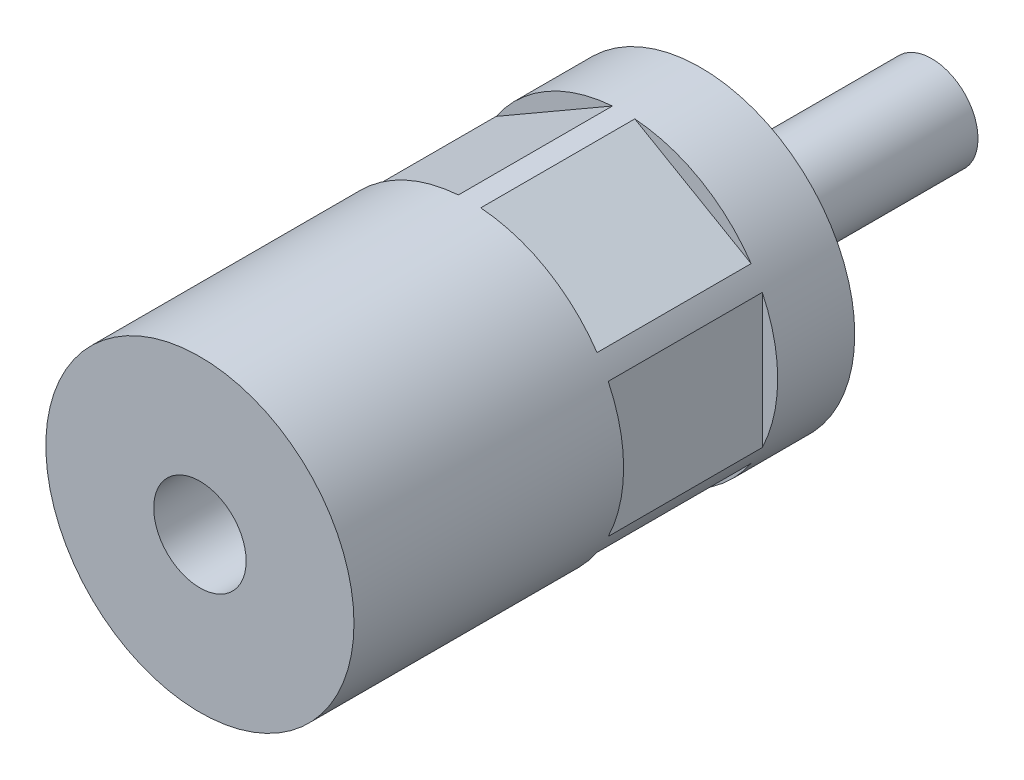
ISO-10303-21;
HEADER;
FILE_DESCRIPTION(('STEP AP214'),'2;1');
FILE_NAME('part.step','',(''),(''),'','','');
FILE_SCHEMA(('AUTOMOTIVE_DESIGN { 1 0 10303 214 1 1 1 1 }'));
ENDSEC;
DATA;
#1=APPLICATION_CONTEXT('core data for automotive mechanical design processes');
#2=APPLICATION_PROTOCOL_DEFINITION('international standard','automotive_design',2000,#1);
#3=PRODUCT_CONTEXT('',#1,'mechanical');
#4=PRODUCT('Part','Part','',(#3));
#5=PRODUCT_RELATED_PRODUCT_CATEGORY('part','',(#4));
#6=PRODUCT_DEFINITION_FORMATION('','',#4);
#7=PRODUCT_DEFINITION_CONTEXT('part definition',#1,'design');
#8=PRODUCT_DEFINITION('design','',#6,#7);
#9=PRODUCT_DEFINITION_SHAPE('','',#8);
#10=(LENGTH_UNIT() NAMED_UNIT(*) SI_UNIT(.MILLI.,.METRE.));
#11=(NAMED_UNIT(*) PLANE_ANGLE_UNIT() SI_UNIT($,.RADIAN.));
#12=(NAMED_UNIT(*) SI_UNIT($,.STERADIAN.) SOLID_ANGLE_UNIT());
#13=UNCERTAINTY_MEASURE_WITH_UNIT(LENGTH_MEASURE(1.E-05),#10,'distance_accuracy_value','');
#14=(GEOMETRIC_REPRESENTATION_CONTEXT(3) GLOBAL_UNCERTAINTY_ASSIGNED_CONTEXT((#13)) GLOBAL_UNIT_ASSIGNED_CONTEXT((#10,
#11,#12)) REPRESENTATION_CONTEXT('',''));
#15=CARTESIAN_POINT('',(0.,0.,0.));
#16=DIRECTION('',(0.,0.,1.));
#17=DIRECTION('',(1.,0.,0.));
#18=AXIS2_PLACEMENT_3D('',#15,#16,#17);
#19=CARTESIAN_POINT('',(0.,0.,80.));
#20=DIRECTION('',(0.,0.,1.));
#21=DIRECTION('',(1.,0.,0.));
#22=AXIS2_PLACEMENT_3D('',#19,#20,#21);
#23=CYLINDRICAL_SURFACE('',#22,20.);
#24=CARTESIAN_POINT('',(0.,0.,10.));
#25=DIRECTION('',(0.,0.,1.));
#26=DIRECTION('',(1.,0.,0.));
#27=AXIS2_PLACEMENT_3D('',#24,#25,#26);
#28=CIRCLE('',#27,20.);
#29=CARTESIAN_POINT('',(-16.5498344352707,-11.2295583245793,10.));
#30=VERTEX_POINT('',#29);
#31=CARTESIAN_POINT('',(-1.45016556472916,-19.9473562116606,10.));
#32=VERTEX_POINT('',#31);
#33=EDGE_CURVE('E152',#30,#32,#28,.T.);
#34=ORIENTED_EDGE('',*,*,#33,.F.);
#35=DIRECTION('',(0.,0.,1.));
#36=VECTOR('',#35,1.);
#37=CARTESIAN_POINT('',(-16.5498344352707,-11.2295583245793,80.));
#38=LINE('',#37,#36);
#39=CARTESIAN_POINT('',(-16.5498344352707,-11.2295583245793,30.));
#40=VERTEX_POINT('',#39);
#41=EDGE_CURVE('E9',#30,#40,#38,.T.);
#42=ORIENTED_EDGE('',*,*,#41,.T.);
#43=CARTESIAN_POINT('',(0.,0.,30.));
#44=DIRECTION('',(0.,0.,1.));
#45=DIRECTION('',(1.,0.,0.));
#46=AXIS2_PLACEMENT_3D('',#43,#44,#45);
#47=CIRCLE('',#46,20.);
#48=CARTESIAN_POINT('',(-1.45016556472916,-19.9473562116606,30.));
#49=VERTEX_POINT('',#48);
#50=EDGE_CURVE('E22',#40,#49,#47,.T.);
#51=ORIENTED_EDGE('',*,*,#50,.T.);
#52=DIRECTION('',(0.,0.,1.));
#53=VECTOR('',#52,1.);
#54=CARTESIAN_POINT('',(-1.45016556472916,-19.9473562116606,80.));
#55=LINE('',#54,#53);
#56=EDGE_CURVE('E149',#49,#32,#55,.F.);
#57=ORIENTED_EDGE('',*,*,#56,.T.);
#58=EDGE_LOOP('',(#34,#42,#51,#57));
#59=FACE_BOUND('',#58,.T.);
#60=DIRECTION('',(0.,0.,1.));
#61=VECTOR('',#60,1.);
#62=CARTESIAN_POINT('',(18.,8.71779788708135,80.));
#63=LINE('',#62,#61);
#64=CARTESIAN_POINT('',(18.,8.71779788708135,10.));
#65=VERTEX_POINT('',#64);
#66=CARTESIAN_POINT('',(18.,8.71779788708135,30.));
#67=VERTEX_POINT('',#66);
#68=EDGE_CURVE('E142',#65,#67,#63,.T.);
#69=ORIENTED_EDGE('',*,*,#68,.F.);
#70=CARTESIAN_POINT('',(18.,-8.71779788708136,10.));
#71=VERTEX_POINT('',#70);
#72=EDGE_CURVE('E141',#71,#65,#28,.T.);
#73=ORIENTED_EDGE('',*,*,#72,.F.);
#74=DIRECTION('',(0.,0.,1.));
#75=VECTOR('',#74,1.);
#76=CARTESIAN_POINT('',(18.,-8.71779788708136,80.));
#77=LINE('',#76,#75);
#78=CARTESIAN_POINT('',(18.,-8.71779788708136,30.));
#79=VERTEX_POINT('',#78);
#80=EDGE_CURVE('E138',#79,#71,#77,.F.);
#81=ORIENTED_EDGE('',*,*,#80,.F.);
#82=EDGE_CURVE('E145',#79,#67,#47,.T.);
#83=ORIENTED_EDGE('',*,*,#82,.T.);
#84=EDGE_LOOP('',(#69,#73,#81,#83));
#85=FACE_BOUND('',#84,.T.);
#86=CARTESIAN_POINT('',(16.5498344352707,11.2295583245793,10.));
#87=VERTEX_POINT('',#86);
#88=CARTESIAN_POINT('',(1.45016556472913,19.9473562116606,10.));
#89=VERTEX_POINT('',#88);
#90=EDGE_CURVE('E134',#87,#89,#28,.T.);
#91=ORIENTED_EDGE('',*,*,#90,.F.);
#92=DIRECTION('',(0.,0.,1.));
#93=VECTOR('',#92,1.);
#94=CARTESIAN_POINT('',(16.5498344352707,11.2295583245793,80.));
#95=LINE('',#94,#93);
#96=CARTESIAN_POINT('',(16.5498344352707,11.2295583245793,30.));
#97=VERTEX_POINT('',#96);
#98=EDGE_CURVE('E135',#87,#97,#95,.T.);
#99=ORIENTED_EDGE('',*,*,#98,.T.);
#100=CARTESIAN_POINT('',(1.45016556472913,19.9473562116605,30.));
#101=VERTEX_POINT('',#100);
#102=EDGE_CURVE('E139',#97,#101,#47,.T.);
#103=ORIENTED_EDGE('',*,*,#102,.T.);
#104=DIRECTION('',(0.,0.,1.));
#105=VECTOR('',#104,1.);
#106=CARTESIAN_POINT('',(1.45016556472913,19.9473562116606,80.));
#107=LINE('',#106,#105);
#108=EDGE_CURVE('E131',#101,#89,#107,.F.);
#109=ORIENTED_EDGE('',*,*,#108,.T.);
#110=EDGE_LOOP('',(#91,#99,#103,#109));
#111=FACE_BOUND('',#110,.T.);
#112=CARTESIAN_POINT('',(0.,0.,0.));
#113=DIRECTION('',(0.,0.,1.));
#114=DIRECTION('',(1.,0.,0.));
#115=AXIS2_PLACEMENT_3D('',#112,#113,#114);
#116=CIRCLE('',#115,20.);
#117=CARTESIAN_POINT('',(20.,0.,0.));
#118=VERTEX_POINT('',#117);
#119=EDGE_CURVE('E204',#118,#118,#116,.T.);
#120=ORIENTED_EDGE('',*,*,#119,.T.);
#121=EDGE_LOOP('',(#120));
#122=FACE_BOUND('',#121,.T.);
#123=CARTESIAN_POINT('',(0.,0.,65.));
#124=DIRECTION('',(0.,0.,1.));
#125=DIRECTION('',(1.,0.,0.));
#126=AXIS2_PLACEMENT_3D('',#123,#124,#125);
#127=CIRCLE('',#126,20.);
#128=CARTESIAN_POINT('',(20.,0.,65.));
#129=VERTEX_POINT('',#128);
#130=EDGE_CURVE('E201',#129,#129,#127,.T.);
#131=ORIENTED_EDGE('',*,*,#130,.F.);
#132=EDGE_LOOP('',(#131));
#133=FACE_BOUND('',#132,.T.);
#134=CARTESIAN_POINT('',(-18.,8.71779788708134,10.));
#135=VERTEX_POINT('',#134);
#136=CARTESIAN_POINT('',(-18.,-8.71779788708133,10.));
#137=VERTEX_POINT('',#136);
#138=EDGE_CURVE('E111',#135,#137,#28,.T.);
#139=ORIENTED_EDGE('',*,*,#138,.F.);
#140=DIRECTION('',(0.,0.,1.));
#141=VECTOR('',#140,1.);
#142=CARTESIAN_POINT('',(-18.,8.71779788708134,80.));
#143=LINE('',#142,#141);
#144=CARTESIAN_POINT('',(-18.,8.71779788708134,30.));
#145=VERTEX_POINT('',#144);
#146=EDGE_CURVE('E110',#135,#145,#143,.T.);
#147=ORIENTED_EDGE('',*,*,#146,.T.);
#148=CARTESIAN_POINT('',(-18.,-8.71779788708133,30.));
#149=VERTEX_POINT('',#148);
#150=EDGE_CURVE('E103',#145,#149,#47,.T.);
#151=ORIENTED_EDGE('',*,*,#150,.T.);
#152=DIRECTION('',(0.,0.,1.));
#153=VECTOR('',#152,1.);
#154=CARTESIAN_POINT('',(-18.,-8.71779788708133,80.));
#155=LINE('',#154,#153);
#156=EDGE_CURVE('E117',#149,#137,#155,.F.);
#157=ORIENTED_EDGE('',*,*,#156,.T.);
#158=EDGE_LOOP('',(#139,#147,#151,#157));
#159=FACE_BOUND('',#158,.T.);
#160=DIRECTION('',(0.,0.,1.));
#161=VECTOR('',#160,1.);
#162=CARTESIAN_POINT('',(-16.5498344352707,11.2295583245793,80.));
#163=LINE('',#162,#161);
#164=CARTESIAN_POINT('',(-16.5498344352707,11.2295583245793,10.));
#165=VERTEX_POINT('',#164);
#166=CARTESIAN_POINT('',(-16.5498344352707,11.2295583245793,30.));
#167=VERTEX_POINT('',#166);
#168=EDGE_CURVE('E129',#165,#167,#163,.T.);
#169=ORIENTED_EDGE('',*,*,#168,.F.);
#170=CARTESIAN_POINT('',(-1.45016556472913,19.9473562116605,10.));
#171=VERTEX_POINT('',#170);
#172=EDGE_CURVE('E125',#171,#165,#28,.T.);
#173=ORIENTED_EDGE('',*,*,#172,.F.);
#174=DIRECTION('',(0.,0.,1.));
#175=VECTOR('',#174,1.);
#176=CARTESIAN_POINT('',(-1.45016556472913,19.9473562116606,80.));
#177=LINE('',#176,#175);
#178=CARTESIAN_POINT('',(-1.45016556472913,19.9473562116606,30.));
#179=VERTEX_POINT('',#178);
#180=EDGE_CURVE('E123',#179,#171,#177,.F.);
#181=ORIENTED_EDGE('',*,*,#180,.F.);
#182=EDGE_CURVE('E113',#179,#167,#47,.T.);
#183=ORIENTED_EDGE('',*,*,#182,.T.);
#184=EDGE_LOOP('',(#169,#173,#181,#183));
#185=FACE_BOUND('',#184,.T.);
#186=DIRECTION('',(0.,0.,1.));
#187=VECTOR('',#186,1.);
#188=CARTESIAN_POINT('',(16.5498344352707,-11.2295583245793,80.));
#189=LINE('',#188,#187);
#190=CARTESIAN_POINT('',(16.5498344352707,-11.2295583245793,10.));
#191=VERTEX_POINT('',#190);
#192=CARTESIAN_POINT('',(16.5498344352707,-11.2295583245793,30.));
#193=VERTEX_POINT('',#192);
#194=EDGE_CURVE('E148',#191,#193,#189,.T.);
#195=ORIENTED_EDGE('',*,*,#194,.F.);
#196=CARTESIAN_POINT('',(1.45016556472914,-19.9473562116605,10.));
#197=VERTEX_POINT('',#196);
#198=EDGE_CURVE('E147',#197,#191,#28,.T.);
#199=ORIENTED_EDGE('',*,*,#198,.F.);
#200=DIRECTION('',(0.,0.,1.));
#201=VECTOR('',#200,1.);
#202=CARTESIAN_POINT('',(1.45016556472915,-19.9473562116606,80.));
#203=LINE('',#202,#201);
#204=CARTESIAN_POINT('',(1.45016556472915,-19.9473562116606,30.));
#205=VERTEX_POINT('',#204);
#206=EDGE_CURVE('E144',#205,#197,#203,.F.);
#207=ORIENTED_EDGE('',*,*,#206,.F.);
#208=EDGE_CURVE('E150',#205,#193,#47,.T.);
#209=ORIENTED_EDGE('',*,*,#208,.T.);
#210=EDGE_LOOP('',(#195,#199,#207,#209));
#211=FACE_BOUND('',#210,.T.);
#212=ADVANCED_FACE('F14',(#59,#85,#111,#122,#133,#159,#185,#211),#23,.T.);
#213=CARTESIAN_POINT('',(0.,0.,-30.));
#214=DIRECTION('',(0.,0.,1.));
#215=DIRECTION('',(1.,0.,0.));
#216=AXIS2_PLACEMENT_3D('',#213,#214,#215);
#217=PLANE('',#216);
#218=CARTESIAN_POINT('',(0.,0.,-30.));
#219=DIRECTION('',(0.,0.,1.));
#220=DIRECTION('',(1.,0.,0.));
#221=AXIS2_PLACEMENT_3D('',#218,#219,#220);
#222=CIRCLE('',#221,6.);
#223=CARTESIAN_POINT('',(6.,0.,-30.));
#224=VERTEX_POINT('',#223);
#225=EDGE_CURVE('E159',#224,#224,#222,.T.);
#226=ORIENTED_EDGE('',*,*,#225,.F.);
#227=EDGE_LOOP('',(#226));
#228=FACE_BOUND('',#227,.T.);
#229=ADVANCED_FACE('F16',(#228),#217,.F.);
#230=CARTESIAN_POINT('',(0.,0.,80.));
#231=DIRECTION('',(0.,0.,1.));
#232=DIRECTION('',(1.,0.,0.));
#233=AXIS2_PLACEMENT_3D('',#230,#231,#232);
#234=CYLINDRICAL_SURFACE('',#233,6.);
#235=CARTESIAN_POINT('',(0.,0.,-3.5));
#236=DIRECTION('',(0.,0.,1.));
#237=DIRECTION('',(1.,0.,0.));
#238=AXIS2_PLACEMENT_3D('',#235,#236,#237);
#239=CIRCLE('',#238,6.);
#240=CARTESIAN_POINT('',(6.,0.,-3.5));
#241=VERTEX_POINT('',#240);
#242=EDGE_CURVE('E213',#241,#241,#239,.T.);
#243=ORIENTED_EDGE('',*,*,#242,.F.);
#244=EDGE_LOOP('',(#243));
#245=FACE_BOUND('',#244,.T.);
#246=ORIENTED_EDGE('',*,*,#225,.T.);
#247=EDGE_LOOP('',(#246));
#248=FACE_BOUND('',#247,.T.);
#249=ADVANCED_FACE('F219',(#245,#248),#234,.T.);
#250=CARTESIAN_POINT('',(4.7,0.,-3.5));
#251=DIRECTION('',(0.,0.,1.));
#252=DIRECTION('',(1.,0.,0.));
#253=AXIS2_PLACEMENT_3D('',#250,#251,#252);
#254=PLANE('',#253);
#255=ORIENTED_EDGE('',*,*,#242,.T.);
#256=EDGE_LOOP('',(#255));
#257=FACE_BOUND('',#256,.T.);
#258=CARTESIAN_POINT('',(0.,0.,-3.5));
#259=DIRECTION('',(0.,0.,1.));
#260=DIRECTION('',(1.,0.,0.));
#261=AXIS2_PLACEMENT_3D('',#258,#259,#260);
#262=CIRCLE('',#261,4.7);
#263=CARTESIAN_POINT('',(4.7,0.,-3.5));
#264=VERTEX_POINT('',#263);
#265=EDGE_CURVE('E210',#264,#264,#262,.T.);
#266=ORIENTED_EDGE('',*,*,#265,.F.);
#267=EDGE_LOOP('',(#266));
#268=FACE_BOUND('',#267,.T.);
#269=ADVANCED_FACE('F228',(#257,#268),#254,.T.);
#270=CARTESIAN_POINT('',(0.,0.,80.));
#271=DIRECTION('',(0.,0.,1.));
#272=DIRECTION('',(1.,0.,0.));
#273=AXIS2_PLACEMENT_3D('',#270,#271,#272);
#274=CYLINDRICAL_SURFACE('',#273,4.7);
#275=ORIENTED_EDGE('',*,*,#265,.T.);
#276=EDGE_LOOP('',(#275));
#277=FACE_BOUND('',#276,.T.);
#278=CARTESIAN_POINT('',(0.,0.,0.));
#279=DIRECTION('',(0.,0.,1.));
#280=DIRECTION('',(1.,0.,0.));
#281=AXIS2_PLACEMENT_3D('',#278,#279,#280);
#282=CIRCLE('',#281,4.7);
#283=CARTESIAN_POINT('',(4.7,0.,0.));
#284=VERTEX_POINT('',#283);
#285=EDGE_CURVE('E207',#284,#284,#282,.T.);
#286=ORIENTED_EDGE('',*,*,#285,.F.);
#287=EDGE_LOOP('',(#286));
#288=FACE_BOUND('',#287,.T.);
#289=ADVANCED_FACE('F241',(#277,#288),#274,.T.);
#290=CARTESIAN_POINT('',(20.,0.,0.));
#291=DIRECTION('',(0.,0.,-1.));
#292=DIRECTION('',(-1.,0.,0.));
#293=AXIS2_PLACEMENT_3D('',#290,#291,#292);
#294=PLANE('',#293);
#295=ORIENTED_EDGE('',*,*,#285,.T.);
#296=EDGE_LOOP('',(#295));
#297=FACE_BOUND('',#296,.T.);
#298=ORIENTED_EDGE('',*,*,#119,.F.);
#299=EDGE_LOOP('',(#298));
#300=FACE_BOUND('',#299,.T.);
#301=ADVANCED_FACE('F238',(#297,#300),#294,.T.);
#302=CARTESIAN_POINT('',(20.,0.,65.));
#303=DIRECTION('',(0.,0.,-1.));
#304=DIRECTION('',(-1.,0.,0.));
#305=AXIS2_PLACEMENT_3D('',#302,#303,#304);
#306=PLANE('',#305);
#307=CARTESIAN_POINT('',(0.,0.,65.));
#308=DIRECTION('',(0.,0.,1.));
#309=DIRECTION('',(1.,0.,0.));
#310=AXIS2_PLACEMENT_3D('',#307,#308,#309);
#311=CIRCLE('',#310,6.);
#312=CARTESIAN_POINT('',(6.,0.,65.));
#313=VERTEX_POINT('',#312);
#314=EDGE_CURVE('E190',#313,#313,#311,.T.);
#315=ORIENTED_EDGE('',*,*,#314,.F.);
#316=EDGE_LOOP('',(#315));
#317=FACE_BOUND('',#316,.T.);
#318=ORIENTED_EDGE('',*,*,#130,.T.);
#319=EDGE_LOOP('',(#318));
#320=FACE_BOUND('',#319,.T.);
#321=ADVANCED_FACE('F236',(#317,#320),#306,.F.);
#322=CARTESIAN_POINT('',(0.,0.,80.));
#323=DIRECTION('',(0.,0.,1.));
#324=DIRECTION('',(1.,0.,0.));
#325=AXIS2_PLACEMENT_3D('',#322,#323,#324);
#326=CYLINDRICAL_SURFACE('',#325,6.);
#327=CARTESIAN_POINT('',(0.,0.,30.));
#328=DIRECTION('',(0.,0.,1.));
#329=DIRECTION('',(1.,0.,0.));
#330=AXIS2_PLACEMENT_3D('',#327,#328,#329);
#331=CIRCLE('',#330,6.);
#332=CARTESIAN_POINT('',(6.,0.,30.));
#333=VERTEX_POINT('',#332);
#334=EDGE_CURVE('E318',#333,#333,#331,.T.);
#335=ORIENTED_EDGE('',*,*,#334,.F.);
#336=EDGE_LOOP('',(#335));
#337=FACE_BOUND('',#336,.T.);
#338=ORIENTED_EDGE('',*,*,#314,.T.);
#339=EDGE_LOOP('',(#338));
#340=FACE_BOUND('',#339,.T.);
#341=ADVANCED_FACE('F263',(#337,#340),#326,.F.);
#342=CARTESIAN_POINT('',(-18.,10.3923048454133,30.));
#343=DIRECTION('',(1.,0.,0.));
#344=DIRECTION('',(0.,1.,0.));
#345=AXIS2_PLACEMENT_3D('',#342,#343,#344);
#346=PLANE('',#345);
#347=DIRECTION('',(0.,-1.,0.));
#348=VECTOR('',#347,1.);
#349=CARTESIAN_POINT('',(-18.,10.3923048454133,10.));
#350=LINE('',#349,#348);
#351=EDGE_CURVE('E319',#135,#137,#350,.T.);
#352=ORIENTED_EDGE('',*,*,#351,.T.);
#353=ORIENTED_EDGE('',*,*,#156,.F.);
#354=DIRECTION('',(0.,-1.,0.));
#355=VECTOR('',#354,1.);
#356=CARTESIAN_POINT('',(-18.,10.3923048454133,30.));
#357=LINE('',#356,#355);
#358=EDGE_CURVE('E106',#145,#149,#357,.T.);
#359=ORIENTED_EDGE('',*,*,#358,.F.);
#360=ORIENTED_EDGE('',*,*,#146,.F.);
#361=EDGE_LOOP('',(#352,#353,#359,#360));
#362=FACE_BOUND('',#361,.T.);
#363=ADVANCED_FACE('F115',(#362),#346,.F.);
#364=CARTESIAN_POINT('',(0.,0.,10.));
#365=DIRECTION('',(0.,0.,1.));
#366=DIRECTION('',(1.,0.,0.));
#367=AXIS2_PLACEMENT_3D('',#364,#365,#366);
#368=PLANE('',#367);
#369=ORIENTED_EDGE('',*,*,#138,.T.);
#370=ORIENTED_EDGE('',*,*,#351,.F.);
#371=EDGE_LOOP('',(#369,#370));
#372=FACE_BOUND('',#371,.T.);
#373=ADVANCED_FACE('F276',(#372),#368,.T.);
#374=CARTESIAN_POINT('',(0.,0.,30.));
#375=DIRECTION('',(0.,0.,1.));
#376=DIRECTION('',(1.,0.,0.));
#377=AXIS2_PLACEMENT_3D('',#374,#375,#376);
#378=PLANE('',#377);
#379=ORIENTED_EDGE('',*,*,#358,.T.);
#380=ORIENTED_EDGE('',*,*,#150,.F.);
#381=EDGE_LOOP('',(#379,#380));
#382=FACE_BOUND('',#381,.T.);
#383=ADVANCED_FACE('F105',(#382),#378,.F.);
#384=CARTESIAN_POINT('',(-18.,10.3923048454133,30.));
#385=DIRECTION('',(-0.5,0.866025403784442,0.));
#386=DIRECTION('',(-0.866025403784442,-0.5,0.));
#387=AXIS2_PLACEMENT_3D('',#384,#385,#386);
#388=PLANE('',#387);
#389=ORIENTED_EDGE('',*,*,#168,.T.);
#390=DIRECTION('',(0.866025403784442,0.5,0.));
#391=VECTOR('',#390,1.);
#392=CARTESIAN_POINT('',(-18.,10.3923048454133,30.));
#393=LINE('',#392,#391);
#394=EDGE_CURVE('E118',#167,#179,#393,.T.);
#395=ORIENTED_EDGE('',*,*,#394,.T.);
#396=ORIENTED_EDGE('',*,*,#180,.T.);
#397=DIRECTION('',(0.866025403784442,0.5,0.));
#398=VECTOR('',#397,1.);
#399=CARTESIAN_POINT('',(-18.,10.3923048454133,10.));
#400=LINE('',#399,#398);
#401=EDGE_CURVE('E321',#165,#171,#400,.T.);
#402=ORIENTED_EDGE('',*,*,#401,.F.);
#403=EDGE_LOOP('',(#389,#395,#396,#402));
#404=FACE_BOUND('',#403,.T.);
#405=ADVANCED_FACE('F303',(#404),#388,.T.);
#406=ORIENTED_EDGE('',*,*,#172,.T.);
#407=ORIENTED_EDGE('',*,*,#401,.T.);
#408=EDGE_LOOP('',(#406,#407));
#409=FACE_BOUND('',#408,.T.);
#410=ADVANCED_FACE('F291',(#409),#368,.T.);
#411=ORIENTED_EDGE('',*,*,#394,.F.);
#412=ORIENTED_EDGE('',*,*,#182,.F.);
#413=EDGE_LOOP('',(#411,#412));
#414=FACE_BOUND('',#413,.T.);
#415=ADVANCED_FACE('F286',(#414),#378,.F.);
#416=CARTESIAN_POINT('',(18.,10.3923048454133,30.));
#417=DIRECTION('',(-0.499999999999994,-0.866025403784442,0.));
#418=DIRECTION('',(0.866025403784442,-0.499999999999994,0.));
#419=AXIS2_PLACEMENT_3D('',#416,#417,#418);
#420=PLANE('',#419);
#421=DIRECTION('',(-0.866025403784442,0.499999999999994,0.));
#422=VECTOR('',#421,1.);
#423=CARTESIAN_POINT('',(18.,10.3923048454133,10.));
#424=LINE('',#423,#422);
#425=EDGE_CURVE('E329',#87,#89,#424,.T.);
#426=ORIENTED_EDGE('',*,*,#425,.T.);
#427=ORIENTED_EDGE('',*,*,#108,.F.);
#428=DIRECTION('',(-0.866025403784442,0.499999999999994,0.));
#429=VECTOR('',#428,1.);
#430=CARTESIAN_POINT('',(18.,10.3923048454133,30.));
#431=LINE('',#430,#429);
#432=EDGE_CURVE('E192',#97,#101,#431,.T.);
#433=ORIENTED_EDGE('',*,*,#432,.F.);
#434=ORIENTED_EDGE('',*,*,#98,.F.);
#435=EDGE_LOOP('',(#426,#427,#433,#434));
#436=FACE_BOUND('',#435,.T.);
#437=ADVANCED_FACE('F290',(#436),#420,.F.);
#438=ORIENTED_EDGE('',*,*,#90,.T.);
#439=ORIENTED_EDGE('',*,*,#425,.F.);
#440=EDGE_LOOP('',(#438,#439));
#441=FACE_BOUND('',#440,.T.);
#442=ADVANCED_FACE('F284',(#441),#368,.T.);
#443=ORIENTED_EDGE('',*,*,#432,.T.);
#444=ORIENTED_EDGE('',*,*,#102,.F.);
#445=EDGE_LOOP('',(#443,#444));
#446=FACE_BOUND('',#445,.T.);
#447=ADVANCED_FACE('F280',(#446),#378,.F.);
#448=CARTESIAN_POINT('',(18.,10.3923048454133,30.));
#449=DIRECTION('',(1.,0.,0.));
#450=DIRECTION('',(0.,1.,0.));
#451=AXIS2_PLACEMENT_3D('',#448,#449,#450);
#452=PLANE('',#451);
#453=ORIENTED_EDGE('',*,*,#68,.T.);
#454=DIRECTION('',(0.,-1.,0.));
#455=VECTOR('',#454,1.);
#456=CARTESIAN_POINT('',(18.,10.3923048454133,30.));
#457=LINE('',#456,#455);
#458=EDGE_CURVE('E187',#67,#79,#457,.T.);
#459=ORIENTED_EDGE('',*,*,#458,.T.);
#460=ORIENTED_EDGE('',*,*,#80,.T.);
#461=DIRECTION('',(0.,-1.,0.));
#462=VECTOR('',#461,1.);
#463=CARTESIAN_POINT('',(18.,10.3923048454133,10.));
#464=LINE('',#463,#462);
#465=EDGE_CURVE('E328',#65,#71,#464,.T.);
#466=ORIENTED_EDGE('',*,*,#465,.F.);
#467=EDGE_LOOP('',(#453,#459,#460,#466));
#468=FACE_BOUND('',#467,.T.);
#469=ADVANCED_FACE('F283',(#468),#452,.T.);
#470=ORIENTED_EDGE('',*,*,#72,.T.);
#471=ORIENTED_EDGE('',*,*,#465,.T.);
#472=EDGE_LOOP('',(#470,#471));
#473=FACE_BOUND('',#472,.T.);
#474=ADVANCED_FACE('F292',(#473),#368,.T.);
#475=ORIENTED_EDGE('',*,*,#458,.F.);
#476=ORIENTED_EDGE('',*,*,#82,.F.);
#477=EDGE_LOOP('',(#475,#476));
#478=FACE_BOUND('',#477,.T.);
#479=ADVANCED_FACE('F287',(#478),#378,.F.);
#480=CARTESIAN_POINT('',(18.,-10.3923048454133,30.));
#481=DIRECTION('',(0.5,-0.866025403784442,0.));
#482=DIRECTION('',(0.866025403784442,0.5,0.));
#483=AXIS2_PLACEMENT_3D('',#480,#481,#482);
#484=PLANE('',#483);
#485=ORIENTED_EDGE('',*,*,#194,.T.);
#486=DIRECTION('',(-0.866025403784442,-0.5,0.));
#487=VECTOR('',#486,1.);
#488=CARTESIAN_POINT('',(18.,-10.3923048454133,30.));
#489=LINE('',#488,#487);
#490=EDGE_CURVE('E37',#193,#205,#489,.T.);
#491=ORIENTED_EDGE('',*,*,#490,.T.);
#492=ORIENTED_EDGE('',*,*,#206,.T.);
#493=DIRECTION('',(-0.866025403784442,-0.5,0.));
#494=VECTOR('',#493,1.);
#495=CARTESIAN_POINT('',(18.,-10.3923048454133,10.));
#496=LINE('',#495,#494);
#497=EDGE_CURVE('E325',#191,#197,#496,.T.);
#498=ORIENTED_EDGE('',*,*,#497,.F.);
#499=EDGE_LOOP('',(#485,#491,#492,#498));
#500=FACE_BOUND('',#499,.T.);
#501=ADVANCED_FACE('F293',(#500),#484,.T.);
#502=ORIENTED_EDGE('',*,*,#198,.T.);
#503=ORIENTED_EDGE('',*,*,#497,.T.);
#504=EDGE_LOOP('',(#502,#503));
#505=FACE_BOUND('',#504,.T.);
#506=ADVANCED_FACE('F296',(#505),#368,.T.);
#507=ORIENTED_EDGE('',*,*,#490,.F.);
#508=ORIENTED_EDGE('',*,*,#208,.F.);
#509=EDGE_LOOP('',(#507,#508));
#510=FACE_BOUND('',#509,.T.);
#511=ADVANCED_FACE('F185',(#510),#378,.F.);
#512=DIRECTION('',(0.866025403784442,-0.5,0.));
#513=VECTOR('',#512,1.);
#514=CARTESIAN_POINT('',(-18.,-10.3923048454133,30.));
#515=LINE('',#514,#513);
#516=EDGE_CURVE('E186',#40,#49,#515,.T.);
#517=ORIENTED_EDGE('',*,*,#516,.T.);
#518=ORIENTED_EDGE('',*,*,#50,.F.);
#519=EDGE_LOOP('',(#517,#518));
#520=FACE_BOUND('',#519,.T.);
#521=ADVANCED_FACE('F342',(#520),#378,.F.);
#522=ORIENTED_EDGE('',*,*,#33,.T.);
#523=DIRECTION('',(0.866025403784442,-0.5,0.));
#524=VECTOR('',#523,1.);
#525=CARTESIAN_POINT('',(-18.,-10.3923048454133,10.));
#526=LINE('',#525,#524);
#527=EDGE_CURVE('E29',#30,#32,#526,.T.);
#528=ORIENTED_EDGE('',*,*,#527,.F.);
#529=EDGE_LOOP('',(#522,#528));
#530=FACE_BOUND('',#529,.T.);
#531=ADVANCED_FACE('F311',(#530),#368,.T.);
#532=CARTESIAN_POINT('',(-18.,-10.3923048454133,30.));
#533=DIRECTION('',(0.5,0.866025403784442,0.));
#534=DIRECTION('',(-0.866025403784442,0.5,0.));
#535=AXIS2_PLACEMENT_3D('',#532,#533,#534);
#536=PLANE('',#535);
#537=ORIENTED_EDGE('',*,*,#527,.T.);
#538=ORIENTED_EDGE('',*,*,#56,.F.);
#539=ORIENTED_EDGE('',*,*,#516,.F.);
#540=ORIENTED_EDGE('',*,*,#41,.F.);
#541=EDGE_LOOP('',(#537,#538,#539,#540));
#542=FACE_BOUND('',#541,.T.);
#543=ADVANCED_FACE('F307',(#542),#536,.F.);
#544=CARTESIAN_POINT('',(0.,0.,30.));
#545=DIRECTION('',(0.,0.,1.));
#546=DIRECTION('',(1.,0.,0.));
#547=AXIS2_PLACEMENT_3D('',#544,#545,#546);
#548=PLANE('',#547);
#549=ORIENTED_EDGE('',*,*,#334,.T.);
#550=EDGE_LOOP('',(#549));
#551=FACE_BOUND('',#550,.T.);
#552=ADVANCED_FACE('F310',(#551),#548,.T.);
#553=CLOSED_SHELL('',(#212,#229,#249,#269,#289,#301,#321,#341,#363,#373,#383,#405,#410,#415,
#437,#442,#447,#469,#474,#479,#501,#506,#511,#521,#531,#543,#552));
#554=MANIFOLD_SOLID_BREP('B1',#553);
#555=ADVANCED_BREP_SHAPE_REPRESENTATION('',(#18,#554),#14);
#556=SHAPE_DEFINITION_REPRESENTATION(#9,#555);
ENDSEC;
END-ISO-10303-21;
